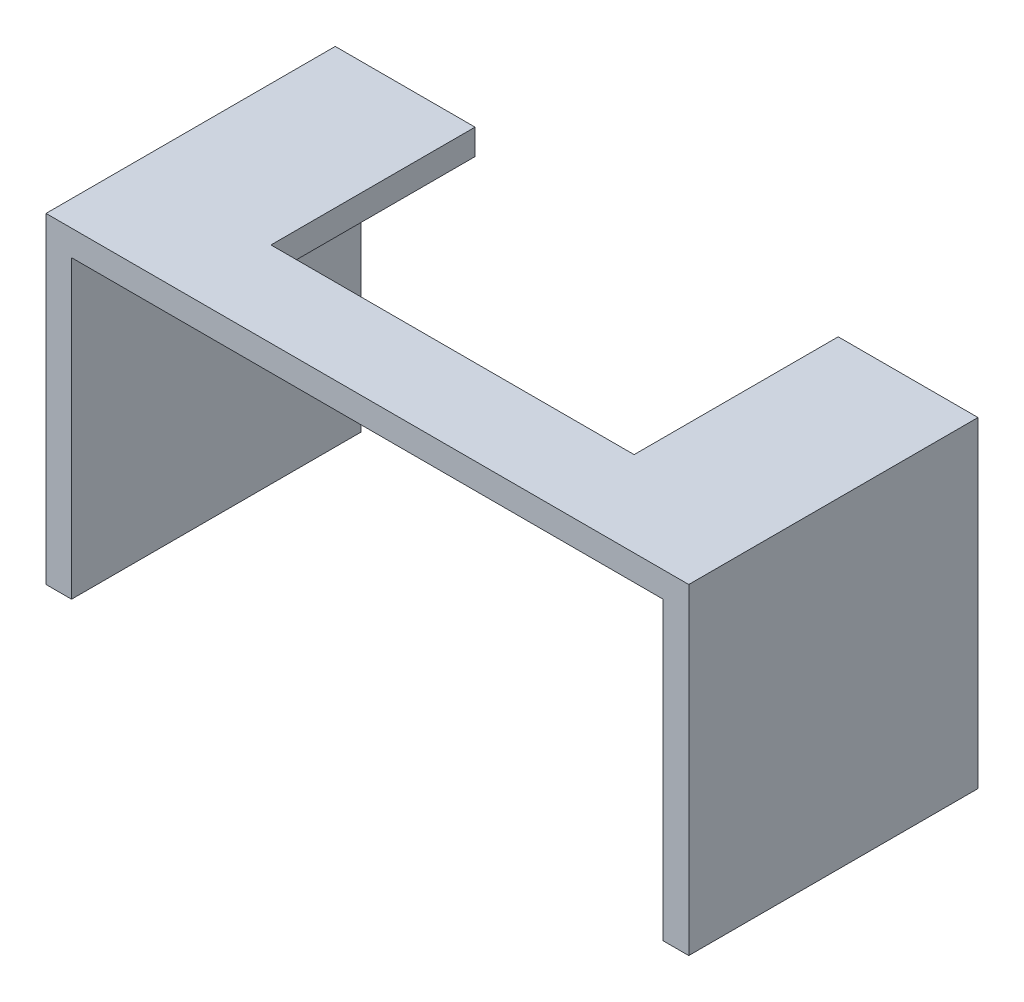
ISO-10303-21;
HEADER;
FILE_DESCRIPTION(('STEP AP214'),'2;1');
FILE_NAME('part.step','',(''),(''),'','','');
FILE_SCHEMA(('AUTOMOTIVE_DESIGN { 1 0 10303 214 1 1 1 1 }'));
ENDSEC;
DATA;
#1=APPLICATION_CONTEXT('core data for automotive mechanical design processes');
#2=APPLICATION_PROTOCOL_DEFINITION('international standard','automotive_design',2000,#1);
#3=PRODUCT_CONTEXT('',#1,'mechanical');
#4=PRODUCT('Part','Part','',(#3));
#5=PRODUCT_RELATED_PRODUCT_CATEGORY('part','',(#4));
#6=PRODUCT_DEFINITION_FORMATION('','',#4);
#7=PRODUCT_DEFINITION_CONTEXT('part definition',#1,'design');
#8=PRODUCT_DEFINITION('design','',#6,#7);
#9=PRODUCT_DEFINITION_SHAPE('','',#8);
#10=(LENGTH_UNIT() NAMED_UNIT(*) SI_UNIT(.MILLI.,.METRE.));
#11=(NAMED_UNIT(*) PLANE_ANGLE_UNIT() SI_UNIT($,.RADIAN.));
#12=(NAMED_UNIT(*) SI_UNIT($,.STERADIAN.) SOLID_ANGLE_UNIT());
#13=UNCERTAINTY_MEASURE_WITH_UNIT(LENGTH_MEASURE(1.E-05),#10,'distance_accuracy_value','');
#14=(GEOMETRIC_REPRESENTATION_CONTEXT(3) GLOBAL_UNCERTAINTY_ASSIGNED_CONTEXT((#13)) GLOBAL_UNIT_ASSIGNED_CONTEXT((#10,
#11,#12)) REPRESENTATION_CONTEXT('',''));
#15=CARTESIAN_POINT('',(0.,0.,0.));
#16=DIRECTION('',(0.,0.,1.));
#17=DIRECTION('',(1.,0.,0.));
#18=AXIS2_PLACEMENT_3D('',#15,#16,#17);
#19=CARTESIAN_POINT('',(0.,0.,0.));
#20=DIRECTION('',(0.,0.,1.));
#21=DIRECTION('',(1.,0.,0.));
#22=AXIS2_PLACEMENT_3D('',#19,#20,#21);
#23=PLANE('',#22);
#24=DIRECTION('',(1.,0.,0.));
#25=VECTOR('',#24,1.);
#26=CARTESIAN_POINT('',(1.59,-1.59,0.));
#27=LINE('',#26,#25);
#28=CARTESIAN_POINT('',(31.3,-1.59,0.));
#29=VERTEX_POINT('',#28);
#30=CARTESIAN_POINT('',(38.41,-1.59,0.));
#31=VERTEX_POINT('',#30);
#32=EDGE_CURVE('E149',#29,#31,#27,.T.);
#33=ORIENTED_EDGE('',*,*,#32,.F.);
#34=DIRECTION('',(0.,1.,0.));
#35=VECTOR('',#34,1.);
#36=CARTESIAN_POINT('',(31.3,0.,0.));
#37=LINE('',#36,#35);
#38=CARTESIAN_POINT('',(31.3,0.,0.));
#39=VERTEX_POINT('',#38);
#40=EDGE_CURVE('E11',#29,#39,#37,.T.);
#41=ORIENTED_EDGE('',*,*,#40,.T.);
#42=DIRECTION('',(-1.,0.,0.));
#43=VECTOR('',#42,1.);
#44=CARTESIAN_POINT('',(0.,0.,0.));
#45=LINE('',#44,#43);
#46=CARTESIAN_POINT('',(40.,0.,0.));
#47=VERTEX_POINT('',#46);
#48=EDGE_CURVE('E159',#47,#39,#45,.T.);
#49=ORIENTED_EDGE('',*,*,#48,.F.);
#50=DIRECTION('',(0.,1.,0.));
#51=VECTOR('',#50,1.);
#52=CARTESIAN_POINT('',(40.,0.,0.));
#53=LINE('',#52,#51);
#54=CARTESIAN_POINT('',(40.,-20.,0.));
#55=VERTEX_POINT('',#54);
#56=EDGE_CURVE('E130',#55,#47,#53,.T.);
#57=ORIENTED_EDGE('',*,*,#56,.F.);
#58=DIRECTION('',(1.,0.,0.));
#59=VECTOR('',#58,1.);
#60=CARTESIAN_POINT('',(38.41,-20.,0.));
#61=LINE('',#60,#59);
#62=CARTESIAN_POINT('',(38.41,-20.,0.));
#63=VERTEX_POINT('',#62);
#64=EDGE_CURVE('E155',#63,#55,#61,.T.);
#65=ORIENTED_EDGE('',*,*,#64,.F.);
#66=DIRECTION('',(0.,-1.,0.));
#67=VECTOR('',#66,1.);
#68=CARTESIAN_POINT('',(38.41,-1.59,0.));
#69=LINE('',#68,#67);
#70=EDGE_CURVE('E153',#31,#63,#69,.T.);
#71=ORIENTED_EDGE('',*,*,#70,.F.);
#72=EDGE_LOOP('',(#33,#41,#49,#57,#65,#71));
#73=FACE_BOUND('',#72,.T.);
#74=ADVANCED_FACE('F33',(#73),#23,.F.);
#75=CARTESIAN_POINT('',(0.,-20.,18.));
#76=DIRECTION('',(0.,1.,0.));
#77=DIRECTION('',(0.,0.,1.));
#78=AXIS2_PLACEMENT_3D('',#75,#76,#77);
#79=PLANE('',#78);
#80=DIRECTION('',(1.,0.,0.));
#81=VECTOR('',#80,1.);
#82=CARTESIAN_POINT('',(0.,-20.,0.));
#83=LINE('',#82,#81);
#84=CARTESIAN_POINT('',(0.,-20.,0.));
#85=VERTEX_POINT('',#84);
#86=CARTESIAN_POINT('',(1.59,-20.,0.));
#87=VERTEX_POINT('',#86);
#88=EDGE_CURVE('E143',#85,#87,#83,.T.);
#89=ORIENTED_EDGE('',*,*,#88,.T.);
#90=DIRECTION('',(0.,0.,-1.));
#91=VECTOR('',#90,1.);
#92=CARTESIAN_POINT('',(1.59,-20.,18.));
#93=LINE('',#92,#91);
#94=CARTESIAN_POINT('',(1.59,-20.,18.));
#95=VERTEX_POINT('',#94);
#96=EDGE_CURVE('E175',#95,#87,#93,.T.);
#97=ORIENTED_EDGE('',*,*,#96,.F.);
#98=DIRECTION('',(1.,0.,0.));
#99=VECTOR('',#98,1.);
#100=CARTESIAN_POINT('',(0.,-20.,18.));
#101=LINE('',#100,#99);
#102=CARTESIAN_POINT('',(0.,-20.,18.));
#103=VERTEX_POINT('',#102);
#104=EDGE_CURVE('E162',#103,#95,#101,.T.);
#105=ORIENTED_EDGE('',*,*,#104,.F.);
#106=DIRECTION('',(0.,0.,-1.));
#107=VECTOR('',#106,1.);
#108=CARTESIAN_POINT('',(0.,-20.,18.));
#109=LINE('',#108,#107);
#110=EDGE_CURVE('E139',#103,#85,#109,.T.);
#111=ORIENTED_EDGE('',*,*,#110,.T.);
#112=EDGE_LOOP('',(#89,#97,#105,#111));
#113=FACE_BOUND('',#112,.T.);
#114=ADVANCED_FACE('F35',(#113),#79,.F.);
#115=CARTESIAN_POINT('',(1.59,-20.,18.));
#116=DIRECTION('',(-1.,0.,0.));
#117=DIRECTION('',(0.,0.,1.));
#118=AXIS2_PLACEMENT_3D('',#115,#116,#117);
#119=PLANE('',#118);
#120=DIRECTION('',(0.,1.,0.));
#121=VECTOR('',#120,1.);
#122=CARTESIAN_POINT('',(1.59,-20.,0.));
#123=LINE('',#122,#121);
#124=CARTESIAN_POINT('',(1.59,-1.59,0.));
#125=VERTEX_POINT('',#124);
#126=EDGE_CURVE('E146',#87,#125,#123,.T.);
#127=ORIENTED_EDGE('',*,*,#126,.T.);
#128=DIRECTION('',(0.,0.,-1.));
#129=VECTOR('',#128,1.);
#130=CARTESIAN_POINT('',(1.59,-1.59,18.));
#131=LINE('',#130,#129);
#132=CARTESIAN_POINT('',(1.59,-1.59,18.));
#133=VERTEX_POINT('',#132);
#134=EDGE_CURVE('E172',#133,#125,#131,.T.);
#135=ORIENTED_EDGE('',*,*,#134,.F.);
#136=DIRECTION('',(0.,1.,0.));
#137=VECTOR('',#136,1.);
#138=CARTESIAN_POINT('',(1.59,-20.,18.));
#139=LINE('',#138,#137);
#140=EDGE_CURVE('E99',#95,#133,#139,.T.);
#141=ORIENTED_EDGE('',*,*,#140,.F.);
#142=ORIENTED_EDGE('',*,*,#96,.T.);
#143=EDGE_LOOP('',(#127,#135,#141,#142));
#144=FACE_BOUND('',#143,.T.);
#145=ADVANCED_FACE('F190',(#144),#119,.F.);
#146=CARTESIAN_POINT('',(1.59,-1.59,18.));
#147=DIRECTION('',(0.,1.,0.));
#148=DIRECTION('',(0.,0.,1.));
#149=AXIS2_PLACEMENT_3D('',#146,#147,#148);
#150=PLANE('',#149);
#151=DIRECTION('',(1.,0.,0.));
#152=VECTOR('',#151,1.);
#153=CARTESIAN_POINT('',(1.59,-1.59,12.7));
#154=LINE('',#153,#152);
#155=CARTESIAN_POINT('',(8.7,-1.59,12.7));
#156=VERTEX_POINT('',#155);
#157=CARTESIAN_POINT('',(31.3,-1.59,12.7));
#158=VERTEX_POINT('',#157);
#159=EDGE_CURVE('E147',#156,#158,#154,.T.);
#160=ORIENTED_EDGE('',*,*,#159,.T.);
#161=DIRECTION('',(0.,0.,-1.));
#162=VECTOR('',#161,1.);
#163=CARTESIAN_POINT('',(31.3,-1.59,18.));
#164=LINE('',#163,#162);
#165=EDGE_CURVE('E336',#158,#29,#164,.T.);
#166=ORIENTED_EDGE('',*,*,#165,.T.);
#167=ORIENTED_EDGE('',*,*,#32,.T.);
#168=DIRECTION('',(0.,0.,-1.));
#169=VECTOR('',#168,1.);
#170=CARTESIAN_POINT('',(38.41,-1.59,18.));
#171=LINE('',#170,#169);
#172=CARTESIAN_POINT('',(38.41,-1.59,18.));
#173=VERTEX_POINT('',#172);
#174=EDGE_CURVE('E169',#173,#31,#171,.T.);
#175=ORIENTED_EDGE('',*,*,#174,.F.);
#176=DIRECTION('',(1.,0.,0.));
#177=VECTOR('',#176,1.);
#178=CARTESIAN_POINT('',(1.59,-1.59,18.));
#179=LINE('',#178,#177);
#180=EDGE_CURVE('E189',#133,#173,#179,.T.);
#181=ORIENTED_EDGE('',*,*,#180,.F.);
#182=ORIENTED_EDGE('',*,*,#134,.T.);
#183=CARTESIAN_POINT('',(8.7,-1.59,0.));
#184=VERTEX_POINT('',#183);
#185=EDGE_CURVE('E150',#125,#184,#27,.T.);
#186=ORIENTED_EDGE('',*,*,#185,.T.);
#187=DIRECTION('',(0.,0.,1.));
#188=VECTOR('',#187,1.);
#189=CARTESIAN_POINT('',(8.7,-1.59,18.));
#190=LINE('',#189,#188);
#191=EDGE_CURVE('E48',#184,#156,#190,.T.);
#192=ORIENTED_EDGE('',*,*,#191,.T.);
#193=EDGE_LOOP('',(#160,#166,#167,#175,#181,#182,#186,#192));
#194=FACE_BOUND('',#193,.T.);
#195=ADVANCED_FACE('F185',(#194),#150,.F.);
#196=CARTESIAN_POINT('',(38.41,-1.59,18.));
#197=DIRECTION('',(1.,0.,0.));
#198=DIRECTION('',(0.,0.,-1.));
#199=AXIS2_PLACEMENT_3D('',#196,#197,#198);
#200=PLANE('',#199);
#201=ORIENTED_EDGE('',*,*,#70,.T.);
#202=DIRECTION('',(0.,0.,-1.));
#203=VECTOR('',#202,1.);
#204=CARTESIAN_POINT('',(38.41,-20.,18.));
#205=LINE('',#204,#203);
#206=CARTESIAN_POINT('',(38.41,-20.,18.));
#207=VERTEX_POINT('',#206);
#208=EDGE_CURVE('E166',#207,#63,#205,.T.);
#209=ORIENTED_EDGE('',*,*,#208,.F.);
#210=DIRECTION('',(0.,-1.,0.));
#211=VECTOR('',#210,1.);
#212=CARTESIAN_POINT('',(38.41,-1.59,18.));
#213=LINE('',#212,#211);
#214=EDGE_CURVE('E347',#173,#207,#213,.T.);
#215=ORIENTED_EDGE('',*,*,#214,.F.);
#216=ORIENTED_EDGE('',*,*,#174,.T.);
#217=EDGE_LOOP('',(#201,#209,#215,#216));
#218=FACE_BOUND('',#217,.T.);
#219=ADVANCED_FACE('F261',(#218),#200,.F.);
#220=CARTESIAN_POINT('',(38.41,-20.,18.));
#221=DIRECTION('',(0.,1.,0.));
#222=DIRECTION('',(0.,0.,1.));
#223=AXIS2_PLACEMENT_3D('',#220,#221,#222);
#224=PLANE('',#223);
#225=ORIENTED_EDGE('',*,*,#64,.T.);
#226=DIRECTION('',(0.,0.,-1.));
#227=VECTOR('',#226,1.);
#228=CARTESIAN_POINT('',(40.,-20.,18.));
#229=LINE('',#228,#227);
#230=CARTESIAN_POINT('',(40.,-20.,18.));
#231=VERTEX_POINT('',#230);
#232=EDGE_CURVE('E134',#231,#55,#229,.T.);
#233=ORIENTED_EDGE('',*,*,#232,.F.);
#234=DIRECTION('',(1.,0.,0.));
#235=VECTOR('',#234,1.);
#236=CARTESIAN_POINT('',(38.41,-20.,18.));
#237=LINE('',#236,#235);
#238=EDGE_CURVE('E121',#207,#231,#237,.T.);
#239=ORIENTED_EDGE('',*,*,#238,.F.);
#240=ORIENTED_EDGE('',*,*,#208,.T.);
#241=EDGE_LOOP('',(#225,#233,#239,#240));
#242=FACE_BOUND('',#241,.T.);
#243=ADVANCED_FACE('F284',(#242),#224,.F.);
#244=CARTESIAN_POINT('',(40.,0.,18.));
#245=DIRECTION('',(-1.,0.,0.));
#246=DIRECTION('',(0.,0.,1.));
#247=AXIS2_PLACEMENT_3D('',#244,#245,#246);
#248=PLANE('',#247);
#249=ORIENTED_EDGE('',*,*,#56,.T.);
#250=DIRECTION('',(0.,0.,-1.));
#251=VECTOR('',#250,1.);
#252=CARTESIAN_POINT('',(40.,0.,18.));
#253=LINE('',#252,#251);
#254=CARTESIAN_POINT('',(40.,0.,18.));
#255=VERTEX_POINT('',#254);
#256=EDGE_CURVE('E127',#255,#47,#253,.T.);
#257=ORIENTED_EDGE('',*,*,#256,.F.);
#258=DIRECTION('',(0.,1.,0.));
#259=VECTOR('',#258,1.);
#260=CARTESIAN_POINT('',(40.,0.,18.));
#261=LINE('',#260,#259);
#262=EDGE_CURVE('E114',#231,#255,#261,.T.);
#263=ORIENTED_EDGE('',*,*,#262,.F.);
#264=ORIENTED_EDGE('',*,*,#232,.T.);
#265=EDGE_LOOP('',(#249,#257,#263,#264));
#266=FACE_BOUND('',#265,.T.);
#267=ADVANCED_FACE('F128',(#266),#248,.F.);
#268=CARTESIAN_POINT('',(0.,0.,18.));
#269=DIRECTION('',(0.,-1.,0.));
#270=DIRECTION('',(0.,0.,-1.));
#271=AXIS2_PLACEMENT_3D('',#268,#269,#270);
#272=PLANE('',#271);
#273=ORIENTED_EDGE('',*,*,#48,.T.);
#274=DIRECTION('',(0.,0.,-1.));
#275=VECTOR('',#274,1.);
#276=CARTESIAN_POINT('',(31.3,0.,12.7));
#277=LINE('',#276,#275);
#278=CARTESIAN_POINT('',(31.3,0.,12.7));
#279=VERTEX_POINT('',#278);
#280=EDGE_CURVE('E325',#279,#39,#277,.T.);
#281=ORIENTED_EDGE('',*,*,#280,.F.);
#282=DIRECTION('',(1.,0.,0.));
#283=VECTOR('',#282,1.);
#284=CARTESIAN_POINT('',(8.7,0.,12.7));
#285=LINE('',#284,#283);
#286=CARTESIAN_POINT('',(8.7,0.,12.7));
#287=VERTEX_POINT('',#286);
#288=EDGE_CURVE('E352',#287,#279,#285,.T.);
#289=ORIENTED_EDGE('',*,*,#288,.F.);
#290=DIRECTION('',(0.,0.,1.));
#291=VECTOR('',#290,1.);
#292=CARTESIAN_POINT('',(8.7,0.,0.));
#293=LINE('',#292,#291);
#294=CARTESIAN_POINT('',(8.7,0.,0.));
#295=VERTEX_POINT('',#294);
#296=EDGE_CURVE('E355',#295,#287,#293,.T.);
#297=ORIENTED_EDGE('',*,*,#296,.F.);
#298=CARTESIAN_POINT('',(0.,0.,0.));
#299=VERTEX_POINT('',#298);
#300=EDGE_CURVE('E158',#295,#299,#45,.T.);
#301=ORIENTED_EDGE('',*,*,#300,.T.);
#302=DIRECTION('',(0.,0.,-1.));
#303=VECTOR('',#302,1.);
#304=CARTESIAN_POINT('',(0.,0.,18.));
#305=LINE('',#304,#303);
#306=CARTESIAN_POINT('',(0.,0.,18.));
#307=VERTEX_POINT('',#306);
#308=EDGE_CURVE('E135',#307,#299,#305,.T.);
#309=ORIENTED_EDGE('',*,*,#308,.F.);
#310=DIRECTION('',(-1.,0.,0.));
#311=VECTOR('',#310,1.);
#312=CARTESIAN_POINT('',(0.,0.,18.));
#313=LINE('',#312,#311);
#314=EDGE_CURVE('E118',#255,#307,#313,.T.);
#315=ORIENTED_EDGE('',*,*,#314,.F.);
#316=ORIENTED_EDGE('',*,*,#256,.T.);
#317=EDGE_LOOP('',(#273,#281,#289,#297,#301,#309,#315,#316));
#318=FACE_BOUND('',#317,.T.);
#319=ADVANCED_FACE('F137',(#318),#272,.F.);
#320=CARTESIAN_POINT('',(0.,-20.,18.));
#321=DIRECTION('',(1.,0.,0.));
#322=DIRECTION('',(0.,0.,-1.));
#323=AXIS2_PLACEMENT_3D('',#320,#321,#322);
#324=PLANE('',#323);
#325=DIRECTION('',(0.,-1.,0.));
#326=VECTOR('',#325,1.);
#327=CARTESIAN_POINT('',(0.,-20.,0.));
#328=LINE('',#327,#326);
#329=EDGE_CURVE('E90',#299,#85,#328,.T.);
#330=ORIENTED_EDGE('',*,*,#329,.T.);
#331=ORIENTED_EDGE('',*,*,#110,.F.);
#332=DIRECTION('',(0.,-1.,0.));
#333=VECTOR('',#332,1.);
#334=CARTESIAN_POINT('',(0.,-20.,18.));
#335=LINE('',#334,#333);
#336=EDGE_CURVE('E57',#307,#103,#335,.T.);
#337=ORIENTED_EDGE('',*,*,#336,.F.);
#338=ORIENTED_EDGE('',*,*,#308,.T.);
#339=EDGE_LOOP('',(#330,#331,#337,#338));
#340=FACE_BOUND('',#339,.T.);
#341=ADVANCED_FACE('F195',(#340),#324,.F.);
#342=CARTESIAN_POINT('',(0.,0.,18.));
#343=DIRECTION('',(0.,0.,1.));
#344=DIRECTION('',(1.,0.,0.));
#345=AXIS2_PLACEMENT_3D('',#342,#343,#344);
#346=PLANE('',#345);
#347=ORIENTED_EDGE('',*,*,#104,.T.);
#348=ORIENTED_EDGE('',*,*,#140,.T.);
#349=ORIENTED_EDGE('',*,*,#180,.T.);
#350=ORIENTED_EDGE('',*,*,#214,.T.);
#351=ORIENTED_EDGE('',*,*,#238,.T.);
#352=ORIENTED_EDGE('',*,*,#262,.T.);
#353=ORIENTED_EDGE('',*,*,#314,.T.);
#354=ORIENTED_EDGE('',*,*,#336,.T.);
#355=EDGE_LOOP('',(#347,#348,#349,#350,#351,#352,#353,#354));
#356=FACE_BOUND('',#355,.T.);
#357=ADVANCED_FACE('F116',(#356),#346,.T.);
#358=ORIENTED_EDGE('',*,*,#300,.F.);
#359=DIRECTION('',(0.,-1.,0.));
#360=VECTOR('',#359,1.);
#361=CARTESIAN_POINT('',(8.7,0.,0.));
#362=LINE('',#361,#360);
#363=EDGE_CURVE('E41',#295,#184,#362,.T.);
#364=ORIENTED_EDGE('',*,*,#363,.T.);
#365=ORIENTED_EDGE('',*,*,#185,.F.);
#366=ORIENTED_EDGE('',*,*,#126,.F.);
#367=ORIENTED_EDGE('',*,*,#88,.F.);
#368=ORIENTED_EDGE('',*,*,#329,.F.);
#369=EDGE_LOOP('',(#358,#364,#365,#366,#367,#368));
#370=FACE_BOUND('',#369,.T.);
#371=ADVANCED_FACE('F179',(#370),#23,.F.);
#372=CARTESIAN_POINT('',(8.7,-10.,12.7));
#373=DIRECTION('',(0.,0.,1.));
#374=DIRECTION('',(1.,0.,0.));
#375=AXIS2_PLACEMENT_3D('',#372,#373,#374);
#376=PLANE('',#375);
#377=DIRECTION('',(0.,1.,0.));
#378=VECTOR('',#377,1.);
#379=CARTESIAN_POINT('',(8.7,-10.,12.7));
#380=LINE('',#379,#378);
#381=EDGE_CURVE('E348',#156,#287,#380,.T.);
#382=ORIENTED_EDGE('',*,*,#381,.T.);
#383=ORIENTED_EDGE('',*,*,#288,.T.);
#384=DIRECTION('',(0.,1.,0.));
#385=VECTOR('',#384,1.);
#386=CARTESIAN_POINT('',(31.3,-10.,12.7));
#387=LINE('',#386,#385);
#388=EDGE_CURVE('E340',#158,#279,#387,.T.);
#389=ORIENTED_EDGE('',*,*,#388,.F.);
#390=ORIENTED_EDGE('',*,*,#159,.F.);
#391=EDGE_LOOP('',(#382,#383,#389,#390));
#392=FACE_BOUND('',#391,.T.);
#393=ADVANCED_FACE('F212',(#392),#376,.F.);
#394=CARTESIAN_POINT('',(31.3,-10.,12.7));
#395=DIRECTION('',(1.,0.,0.));
#396=DIRECTION('',(0.,0.,-1.));
#397=AXIS2_PLACEMENT_3D('',#394,#395,#396);
#398=PLANE('',#397);
#399=ORIENTED_EDGE('',*,*,#388,.T.);
#400=ORIENTED_EDGE('',*,*,#280,.T.);
#401=ORIENTED_EDGE('',*,*,#40,.F.);
#402=ORIENTED_EDGE('',*,*,#165,.F.);
#403=EDGE_LOOP('',(#399,#400,#401,#402));
#404=FACE_BOUND('',#403,.T.);
#405=ADVANCED_FACE('F216',(#404),#398,.F.);
#406=CARTESIAN_POINT('',(8.7,-10.,0.));
#407=DIRECTION('',(-1.,0.,0.));
#408=DIRECTION('',(0.,0.,1.));
#409=AXIS2_PLACEMENT_3D('',#406,#407,#408);
#410=PLANE('',#409);
#411=ORIENTED_EDGE('',*,*,#363,.F.);
#412=ORIENTED_EDGE('',*,*,#296,.T.);
#413=ORIENTED_EDGE('',*,*,#381,.F.);
#414=ORIENTED_EDGE('',*,*,#191,.F.);
#415=EDGE_LOOP('',(#411,#412,#413,#414));
#416=FACE_BOUND('',#415,.T.);
#417=ADVANCED_FACE('F222',(#416),#410,.F.);
#418=CLOSED_SHELL('',(#74,#114,#145,#195,#219,#243,#267,#319,#341,#357,#371,#393,#405,#417));
#419=MANIFOLD_SOLID_BREP('B2',#418);
#420=ADVANCED_BREP_SHAPE_REPRESENTATION('',(#18,#419),#14);
#421=SHAPE_DEFINITION_REPRESENTATION(#9,#420);
ENDSEC;
END-ISO-10303-21;
